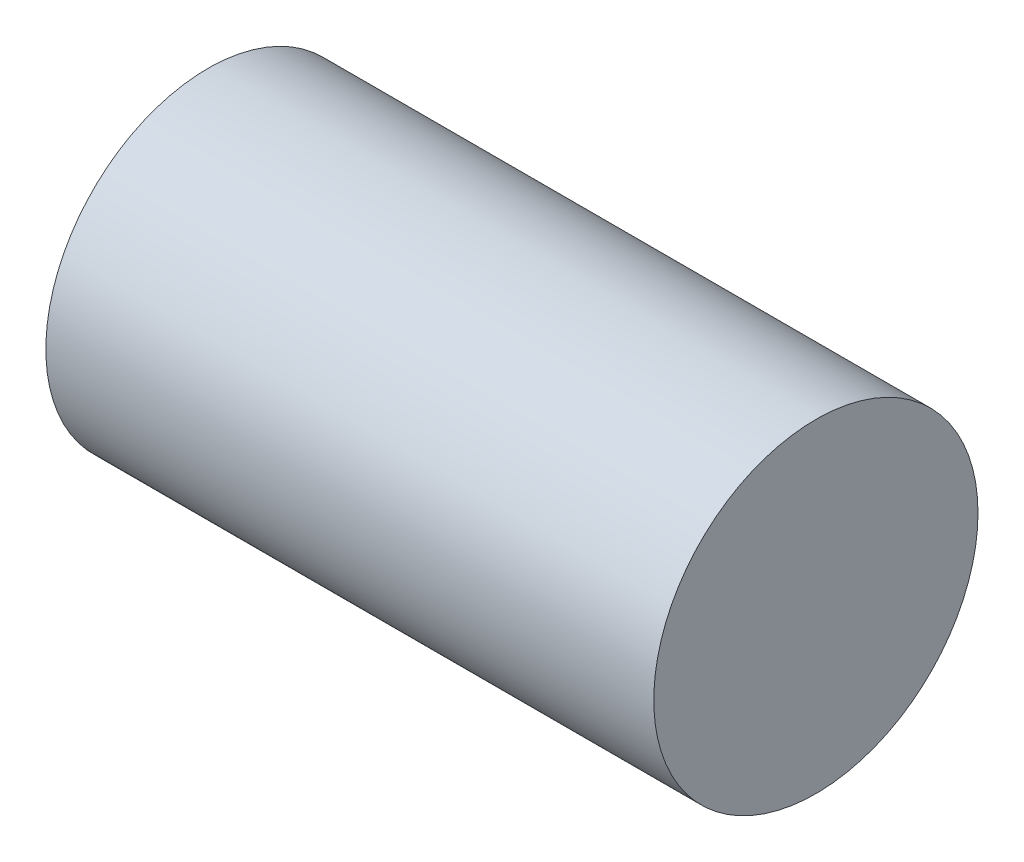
from build123d import *

# Parameters (mm, degrees)
SKETCH1_R           = 4
BOSS_EXTRUDE1_DEPTH = 15


with BuildPart() as part:
    # Sketch1 → Boss-Extrude1 (new body)
    with BuildSketch(Plane(origin=(0, 0, 0), x_dir=(0, 0, -1), z_dir=(1, 0, 0))):
        Circle(SKETCH1_R)
    extrude(amount=BOSS_EXTRUDE1_DEPTH)


solid = part.part
